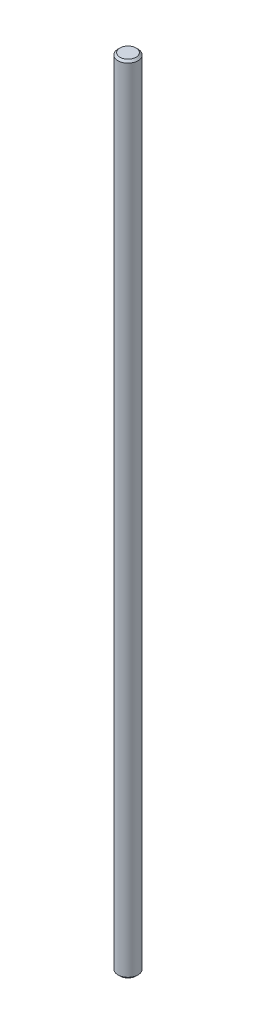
ISO-10303-21;
HEADER;
FILE_DESCRIPTION(('STEP AP214'),'2;1');
FILE_NAME('part.step','',(''),(''),'','','');
FILE_SCHEMA(('AUTOMOTIVE_DESIGN { 1 0 10303 214 1 1 1 1 }'));
ENDSEC;
DATA;
#1=APPLICATION_CONTEXT('core data for automotive mechanical design processes');
#2=APPLICATION_PROTOCOL_DEFINITION('international standard','automotive_design',2000,#1);
#3=PRODUCT_CONTEXT('',#1,'mechanical');
#4=PRODUCT('Part','Part','',(#3));
#5=PRODUCT_RELATED_PRODUCT_CATEGORY('part','',(#4));
#6=PRODUCT_DEFINITION_FORMATION('','',#4);
#7=PRODUCT_DEFINITION_CONTEXT('part definition',#1,'design');
#8=PRODUCT_DEFINITION('design','',#6,#7);
#9=PRODUCT_DEFINITION_SHAPE('','',#8);
#10=(LENGTH_UNIT() NAMED_UNIT(*) SI_UNIT(.MILLI.,.METRE.));
#11=(NAMED_UNIT(*) PLANE_ANGLE_UNIT() SI_UNIT($,.RADIAN.));
#12=(NAMED_UNIT(*) SI_UNIT($,.STERADIAN.) SOLID_ANGLE_UNIT());
#13=UNCERTAINTY_MEASURE_WITH_UNIT(LENGTH_MEASURE(1.E-05),#10,'distance_accuracy_value','');
#14=(GEOMETRIC_REPRESENTATION_CONTEXT(3) GLOBAL_UNCERTAINTY_ASSIGNED_CONTEXT((#13)) GLOBAL_UNIT_ASSIGNED_CONTEXT((#10,
#11,#12)) REPRESENTATION_CONTEXT('',''));
#15=CARTESIAN_POINT('',(0.,0.,0.));
#16=DIRECTION('',(0.,0.,1.));
#17=DIRECTION('',(1.,0.,0.));
#18=AXIS2_PLACEMENT_3D('',#15,#16,#17);
#19=CARTESIAN_POINT('',(0.,158.,0.));
#20=DIRECTION('',(0.,-1.,0.));
#21=DIRECTION('',(0.,0.,-1.));
#22=AXIS2_PLACEMENT_3D('',#19,#20,#21);
#23=CYLINDRICAL_SURFACE('',#22,2.);
#24=CARTESIAN_POINT('',(0.,0.399999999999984,0.));
#25=DIRECTION('',(0.,1.,0.));
#26=DIRECTION('',(0.,0.,1.));
#27=AXIS2_PLACEMENT_3D('',#24,#25,#26);
#28=CIRCLE('',#27,2.);
#29=CARTESIAN_POINT('',(0.,0.399999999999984,2.));
#30=VERTEX_POINT('',#29);
#31=EDGE_CURVE('E44',#30,#30,#28,.T.);
#32=ORIENTED_EDGE('',*,*,#31,.T.);
#33=EDGE_LOOP('',(#32));
#34=FACE_BOUND('',#33,.T.);
#35=CARTESIAN_POINT('',(0.,157.6,0.));
#36=DIRECTION('',(0.,1.,0.));
#37=DIRECTION('',(0.,0.,1.));
#38=AXIS2_PLACEMENT_3D('',#35,#36,#37);
#39=CIRCLE('',#38,2.);
#40=CARTESIAN_POINT('',(0.,157.6,2.));
#41=VERTEX_POINT('',#40);
#42=EDGE_CURVE('E48',#41,#41,#39,.F.);
#43=ORIENTED_EDGE('',*,*,#42,.T.);
#44=EDGE_LOOP('',(#43));
#45=FACE_BOUND('',#44,.T.);
#46=ADVANCED_FACE('F33',(#34,#45),#23,.T.);
#47=CARTESIAN_POINT('',(0.,158.,0.));
#48=DIRECTION('',(0.,1.,0.));
#49=DIRECTION('',(0.,0.,1.));
#50=AXIS2_PLACEMENT_3D('',#47,#48,#49);
#51=PLANE('',#50);
#52=CARTESIAN_POINT('',(0.,158.,0.));
#53=DIRECTION('',(0.,1.,0.));
#54=DIRECTION('',(0.,0.,1.));
#55=AXIS2_PLACEMENT_3D('',#52,#53,#54);
#56=CIRCLE('',#55,1.6);
#57=CARTESIAN_POINT('',(0.,158.,1.6));
#58=VERTEX_POINT('',#57);
#59=EDGE_CURVE('E10',#58,#58,#56,.T.);
#60=ORIENTED_EDGE('',*,*,#59,.T.);
#61=EDGE_LOOP('',(#60));
#62=FACE_BOUND('',#61,.T.);
#63=ADVANCED_FACE('F64',(#62),#51,.T.);
#64=CARTESIAN_POINT('',(0.,0.,0.));
#65=DIRECTION('',(0.,1.,0.));
#66=DIRECTION('',(0.,0.,1.));
#67=AXIS2_PLACEMENT_3D('',#64,#65,#66);
#68=PLANE('',#67);
#69=CARTESIAN_POINT('',(0.,0.,0.));
#70=DIRECTION('',(0.,1.,0.));
#71=DIRECTION('',(0.,0.,1.));
#72=AXIS2_PLACEMENT_3D('',#69,#70,#71);
#73=CIRCLE('',#72,1.60000000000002);
#74=CARTESIAN_POINT('',(0.,0.,1.60000000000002));
#75=VERTEX_POINT('',#74);
#76=EDGE_CURVE('E40',#75,#75,#73,.F.);
#77=ORIENTED_EDGE('',*,*,#76,.T.);
#78=EDGE_LOOP('',(#77));
#79=FACE_BOUND('',#78,.T.);
#80=ADVANCED_FACE('F61',(#79),#68,.F.);
#81=CARTESIAN_POINT('',(0.,0.399999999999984,0.));
#82=DIRECTION('',(0.,1.,0.));
#83=DIRECTION('',(0.,0.,1.));
#84=AXIS2_PLACEMENT_3D('',#81,#82,#83);
#85=CONICAL_SURFACE('',#84,2.,0.785398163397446);
#86=ORIENTED_EDGE('',*,*,#76,.F.);
#87=EDGE_LOOP('',(#86));
#88=FACE_BOUND('',#87,.T.);
#89=ORIENTED_EDGE('',*,*,#31,.F.);
#90=EDGE_LOOP('',(#89));
#91=FACE_BOUND('',#90,.T.);
#92=ADVANCED_FACE('F57',(#88,#91),#85,.T.);
#93=CARTESIAN_POINT('',(0.,158.,0.));
#94=DIRECTION('',(0.,-1.,0.));
#95=DIRECTION('',(0.,0.,-1.));
#96=AXIS2_PLACEMENT_3D('',#93,#94,#95);
#97=CONICAL_SURFACE('',#96,1.6,0.785398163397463);
#98=ORIENTED_EDGE('',*,*,#42,.F.);
#99=EDGE_LOOP('',(#98));
#100=FACE_BOUND('',#99,.T.);
#101=ORIENTED_EDGE('',*,*,#59,.F.);
#102=EDGE_LOOP('',(#101));
#103=FACE_BOUND('',#102,.T.);
#104=ADVANCED_FACE('F35',(#100,#103),#97,.T.);
#105=CLOSED_SHELL('',(#46,#63,#80,#92,#104));
#106=MANIFOLD_SOLID_BREP('B2',#105);
#107=ADVANCED_BREP_SHAPE_REPRESENTATION('',(#18,#106),#14);
#108=SHAPE_DEFINITION_REPRESENTATION(#9,#107);
ENDSEC;
END-ISO-10303-21;
